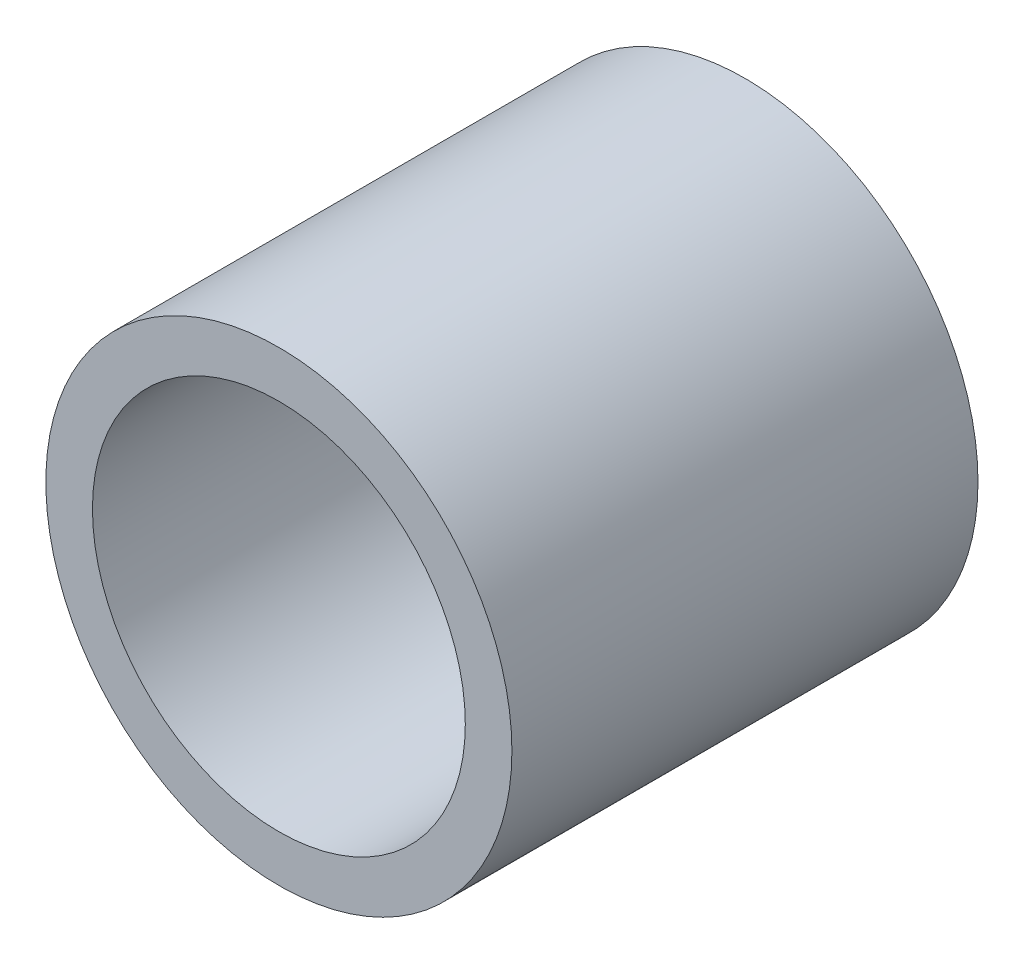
from build123d import *

# Parameters (mm, degrees)
SKETCH1_R      = 20
SKETCH1_R_2    = 16
EXTRUDE1_DEPTH = 40


with BuildPart() as part:
    # Sketch1 → Extrude1 (new body)
    with BuildSketch(Plane.XY):
        Circle(SKETCH1_R)
        Circle(SKETCH1_R_2, mode=Mode.SUBTRACT)
    extrude(amount=EXTRUDE1_DEPTH)


solid = part.part
